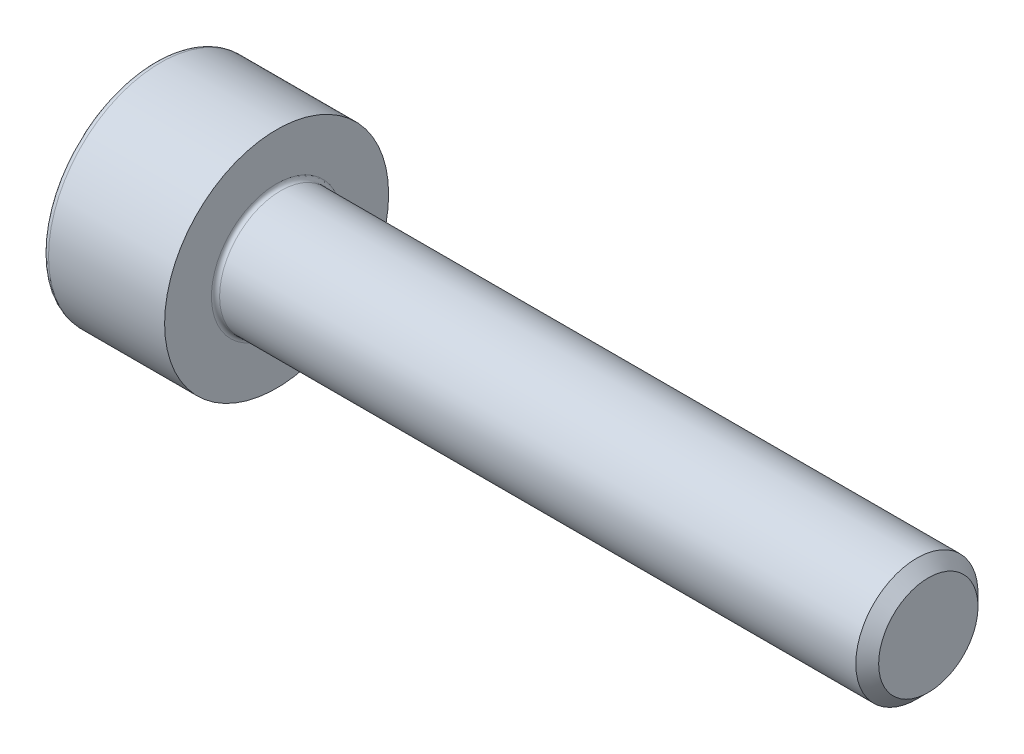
from build123d import *

# Parameters (mm, degrees)
FILLET1_R   = 0.1
FILLET2_R   = 0.15
HEX_2_DEPTH = 1.3


with BuildPart() as part:
    # BodySke → Base-Revolve (revolve)
    with BuildSketch(Plane.XY, mode=Mode.PRIVATE) as base_revolve_sk:
        Polygon((0, 0), (0, 2.75), (3, 2.75), (3, 1.5), (18.7195, 1.5), (19, 1.2195), (19, 0), align=None)
    revolve(base_revolve_sk.sketch.rotate(Axis((-31.75, 0, 0), (1, 0, 0)), 90), axis=Axis((-31.75, 0, 0), (1, 0, 0)))

    # Fillet1
    fillet1_edges = [part.edges().sort_by_distance(p)[0] for p in [
        (3, 0, -1.5),
    ]]
    fillet(fillet1_edges, radius=FILLET1_R)

    # Fillet2
    fillet2_edges = [part.edges().sort_by_distance(p)[0] for p in [
        (0, 0, -2.75),
    ]]
    fillet(fillet2_edges, radius=FILLET2_R)

    # Sketch2 → Hex-PreBroach (revolve, cut)
    with BuildSketch(Plane.XY, mode=Mode.PRIVATE) as hex_prebroach_sk:
        Polygon((0, 1.28), (1.3, 1.28), (2.039008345, 0), (0, 0), align=None)
    revolve(hex_prebroach_sk.sketch.rotate(Axis((0, 0, 0), (1, 0, 0)), 90), axis=Axis((0, 0, 0), (1, 0, 0)), mode=Mode.SUBTRACT)

    # Sketch3 → Hex 2 (cut)
    with BuildSketch(Plane(origin=(0, 0, 0), x_dir=(0, 0.500000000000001, 0.866025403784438), z_dir=(-1, 0, 0))):
        Polygon((0.739008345, 1.28), (-0.739008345, 1.28), (-1.478016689, 0), (-0.739008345, -1.28), (0.739008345, -1.28), (1.478016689, 0), align=None)
    extrude(amount=-HEX_2_DEPTH, mode=Mode.SUBTRACT)


solid = part.part
